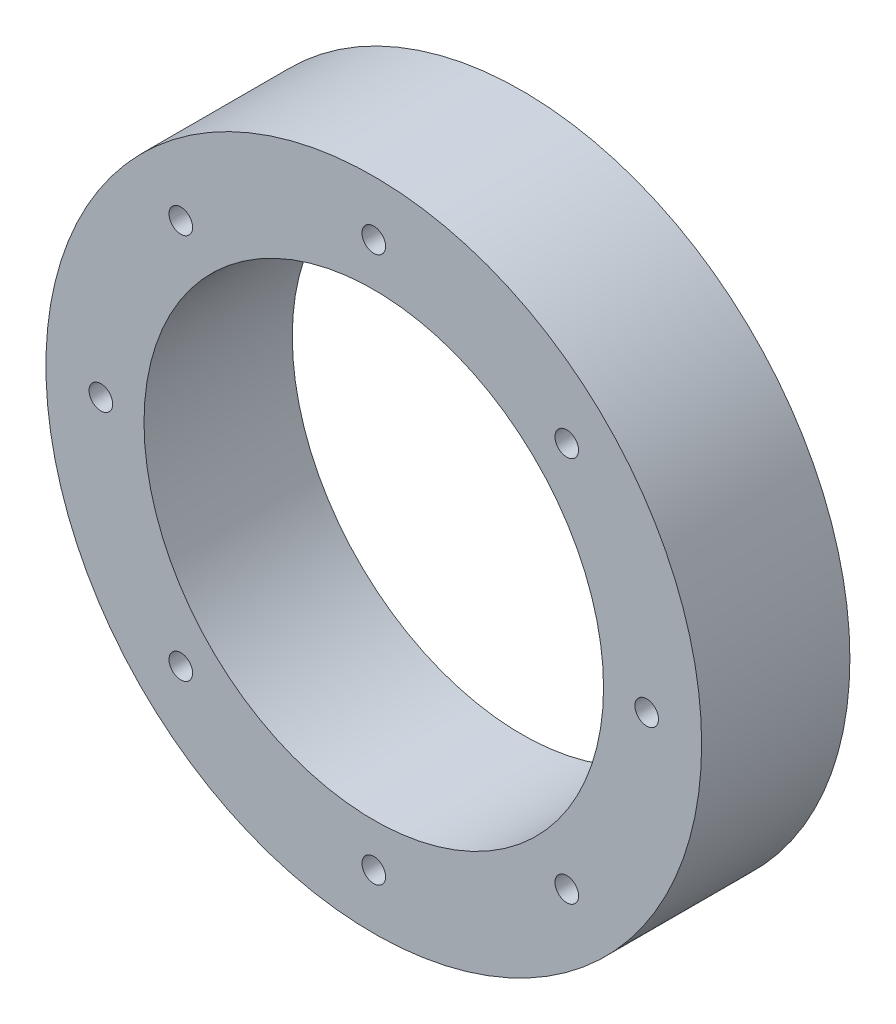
from build123d import *

# Parameters (mm, degrees)
SKETCH1_R           = 44.45
SKETCH1_R_2         = 31.15
SKETCH1_R_3         = 1.6
BOSS_EXTRUDE1_DEPTH = 10.05


with BuildPart() as part:
    # Sketch1 → Boss-Extrude1 (new, symmetric)
    with BuildSketch(Plane(origin=(0, 0, 0), x_dir=(0, 1, 0), z_dir=(0, 0, 1))):
        with Locations(Location((0, 0, 0), (0, 0, 270))):
            Circle(SKETCH1_R)
        with Locations(Location((0, 0, 0), (0, 0, 270))):
            Circle(SKETCH1_R_2, mode=Mode.SUBTRACT)
        with Locations(Location((37, 0, 0), (0, 0, 270))):
            Circle(SKETCH1_R_3, mode=Mode.SUBTRACT)
        with Locations(Location((26.162950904, -26.162950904, 0), (0, 0, 270))):
            Circle(SKETCH1_R_3, mode=Mode.SUBTRACT)
        with Locations(Location((0, -37, 0), (0, 0, 270))):
            Circle(SKETCH1_R_3, mode=Mode.SUBTRACT)
        with Locations(Location((-26.162950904, -26.162950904, 0), (0, 0, 270))):
            Circle(SKETCH1_R_3, mode=Mode.SUBTRACT)
        with Locations(Location((-37, 0, 0), (0, 0, 270))):
            Circle(SKETCH1_R_3, mode=Mode.SUBTRACT)
        with Locations(Location((-26.162950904, 26.162950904, 0), (0, 0, 270))):
            Circle(SKETCH1_R_3, mode=Mode.SUBTRACT)
        with Locations(Location((0, 37, 0), (0, 0, 270))):
            Circle(SKETCH1_R_3, mode=Mode.SUBTRACT)
        with Locations(Location((26.162950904, 26.162950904, 0), (0, 0, 270))):
            Circle(SKETCH1_R_3, mode=Mode.SUBTRACT)
    extrude(amount=BOSS_EXTRUDE1_DEPTH, both=True)


solid = part.part
